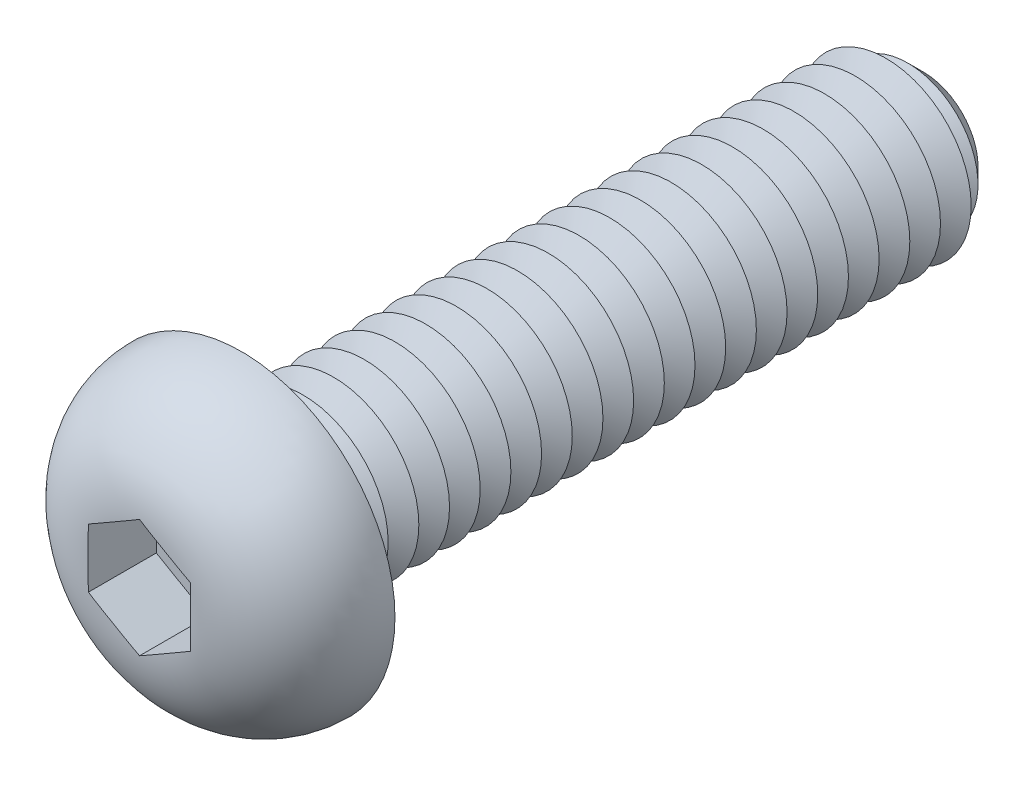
from build123d import *

# Parameters (mm, degrees)
CUT_EXTRUDE1_DEPTH  = 1
SKETCH4_R           = 1.25
BOSS_EXTRUDE1_DEPTH = 10
CHAMFER1_SIZE       = 0.45
LPATTERN1_COUNT     = 21
LPATTERN1_PITCH     = 0.45
FILLET2_R           = 0.225
SKETCH6_R           = 0.45
CUT_EXTRUDE2_DEPTH  = 10.5


with BuildPart() as part:
    # Sketch2 → Revolve1 (revolve)
    with BuildSketch(Plane(origin=(0, 0, 0), x_dir=(0, 0, -1), z_dir=(1, 0, 0)), mode=Mode.PRIVATE) as revolve1_sk:
        with BuildLine():
            Line((0, 0), (-1.5, 0))
            Line((-1.5, 0), (-1.5, 0.75))
            ThreePointArc((-1.5, 0.75), (-1.060660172, 1.810660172), (0, 2.25))
            Line((0, 2.25), (0, 0))
        make_face()
    revolve(revolve1_sk.sketch.rotate(Axis((0, 0, 47.934239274), (0, 0, -1)), 90), axis=Axis((0, 0, 47.934239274), (0, 0, -1)))

    # Sketch3 → Cut-Extrude1 (cut)
    with BuildSketch(Plane.XY.offset(1.5)):
        Polygon((0, 0.866025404), (-0.75, 0.433012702), (-0.75, -0.433012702), (0, -0.866025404), (0.75, -0.433012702), (0.75, 0.433012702), align=None)
    extrude(amount=-CUT_EXTRUDE1_DEPTH, mode=Mode.SUBTRACT)

    # Sketch4 → Boss-Extrude1 (add)
    with BuildSketch(Plane(origin=(0, 0, 0), x_dir=(-1, 0, 0), z_dir=(0, 0, -1))):
        with Locations(Location((0, 0, 0), (0, 0, 180))):
            Circle(SKETCH4_R)
    extrude(amount=BOSS_EXTRUDE1_DEPTH)

    # Chamfer1
    chamfer1_edges = [part.edges().sort_by_distance(p)[0] for p in [
        (-1.25, 0, -10),
    ]]
    chamfer(chamfer1_edges, length=CHAMFER1_SIZE)

    # Sketch5 → Cut-Revolve1 (revolve, cut)
    with BuildSketch(Plane(origin=(0, 0, 0), x_dir=(0, 0, -1), z_dir=(1, 0, 0)), mode=Mode.PRIVATE) as cut_revolve1_sk:
        Polygon((0.45, 1.25), (0.9, 1.25), (0.675, 0.860288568), align=None)
    cut_revolve1 = revolve(cut_revolve1_sk.sketch.rotate(Axis((0, 0, 47.934239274), (0, 0, -1)), 90), axis=Axis((0, 0, 47.934239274), (0, 0, -1)), mode=Mode.SUBTRACT)

    # LPattern1: Cut-Revolve1 ×21
    with Locations(*[(0, 0, -i * LPATTERN1_PITCH) for i in range(1, LPATTERN1_COUNT)]):
        add(cut_revolve1, mode=Mode.SUBTRACT)

    # Fillet2
    fillet2_edges = [part.edges().sort_by_distance(p)[0] for p in [
        (-1.25, 0, 0),
    ]]
    fillet(fillet2_edges, radius=FILLET2_R)

    # Sketch6 → Cut-Extrude2 (cut)
    with BuildSketch(Plane.XY.offset(0.5)):
        Circle(SKETCH6_R)
    extrude(amount=-CUT_EXTRUDE2_DEPTH, mode=Mode.SUBTRACT)


solid = part.part
